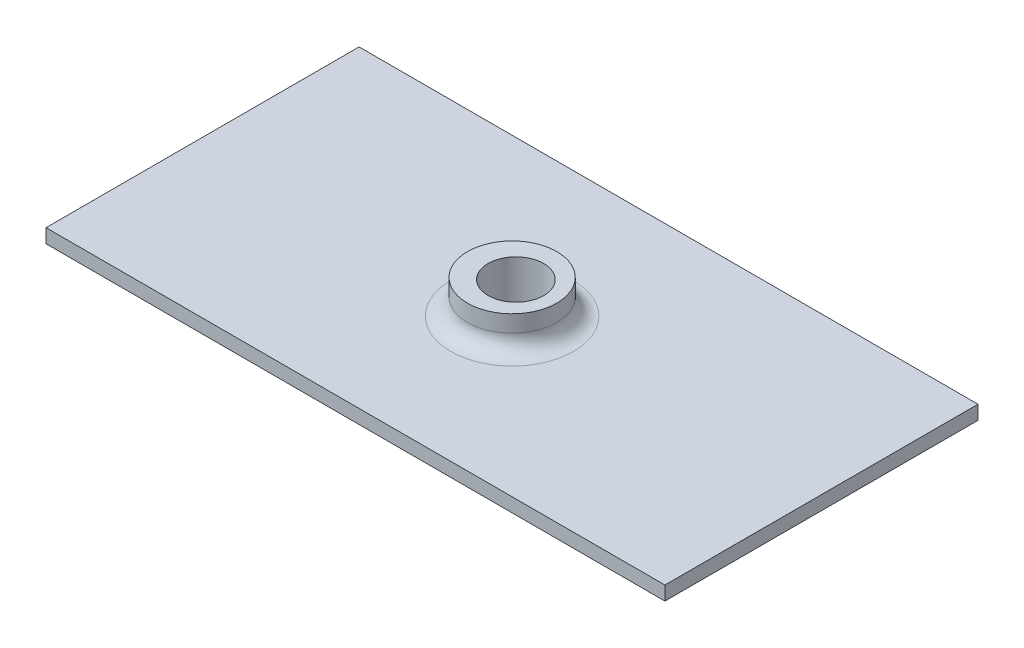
ISO-10303-21;
HEADER;
FILE_DESCRIPTION(('STEP AP214'),'2;1');
FILE_NAME('part.step','',(''),(''),'','','');
FILE_SCHEMA(('AUTOMOTIVE_DESIGN { 1 0 10303 214 1 1 1 1 }'));
ENDSEC;
DATA;
#1=APPLICATION_CONTEXT('core data for automotive mechanical design processes');
#2=APPLICATION_PROTOCOL_DEFINITION('international standard','automotive_design',2000,#1);
#3=PRODUCT_CONTEXT('',#1,'mechanical');
#4=PRODUCT('Part','Part','',(#3));
#5=PRODUCT_RELATED_PRODUCT_CATEGORY('part','',(#4));
#6=PRODUCT_DEFINITION_FORMATION('','',#4);
#7=PRODUCT_DEFINITION_CONTEXT('part definition',#1,'design');
#8=PRODUCT_DEFINITION('design','',#6,#7);
#9=PRODUCT_DEFINITION_SHAPE('','',#8);
#10=(LENGTH_UNIT() NAMED_UNIT(*) SI_UNIT(.MILLI.,.METRE.));
#11=(NAMED_UNIT(*) PLANE_ANGLE_UNIT() SI_UNIT($,.RADIAN.));
#12=(NAMED_UNIT(*) SI_UNIT($,.STERADIAN.) SOLID_ANGLE_UNIT());
#13=UNCERTAINTY_MEASURE_WITH_UNIT(LENGTH_MEASURE(1.E-05),#10,'distance_accuracy_value','');
#14=(GEOMETRIC_REPRESENTATION_CONTEXT(3) GLOBAL_UNCERTAINTY_ASSIGNED_CONTEXT((#13)) GLOBAL_UNIT_ASSIGNED_CONTEXT((#10,
#11,#12)) REPRESENTATION_CONTEXT('',''));
#15=CARTESIAN_POINT('',(0.,0.,0.));
#16=DIRECTION('',(0.,0.,1.));
#17=DIRECTION('',(1.,0.,0.));
#18=AXIS2_PLACEMENT_3D('',#15,#16,#17);
#19=CARTESIAN_POINT('',(0.,2.5,-28.05));
#20=DIRECTION('',(0.,0.,-1.));
#21=DIRECTION('',(-1.,0.,0.));
#22=AXIS2_PLACEMENT_3D('',#19,#20,#21);
#23=PLANE('',#22);
#24=DIRECTION('',(1.,0.,0.));
#25=VECTOR('',#24,1.);
#26=CARTESIAN_POINT('',(0.,0.,-28.05));
#27=LINE('',#26,#25);
#28=CARTESIAN_POINT('',(-56.1500000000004,0.,-28.0499999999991));
#29=VERTEX_POINT('',#28);
#30=CARTESIAN_POINT('',(54.75,0.,-28.05));
#31=VERTEX_POINT('',#30);
#32=EDGE_CURVE('E113',#29,#31,#27,.T.);
#33=ORIENTED_EDGE('',*,*,#32,.F.);
#34=DIRECTION('',(0.,-1.,0.));
#35=VECTOR('',#34,1.);
#36=CARTESIAN_POINT('',(-56.1500000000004,2.5,-28.0499999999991));
#37=LINE('',#36,#35);
#38=CARTESIAN_POINT('',(-56.1500000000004,2.5,-28.0499999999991));
#39=VERTEX_POINT('',#38);
#40=EDGE_CURVE('E88',#39,#29,#37,.T.);
#41=ORIENTED_EDGE('',*,*,#40,.F.);
#42=DIRECTION('',(1.,0.,0.));
#43=VECTOR('',#42,1.);
#44=CARTESIAN_POINT('',(0.,2.5,-28.05));
#45=LINE('',#44,#43);
#46=CARTESIAN_POINT('',(54.75,2.5,-28.05));
#47=VERTEX_POINT('',#46);
#48=EDGE_CURVE('E106',#39,#47,#45,.T.);
#49=ORIENTED_EDGE('',*,*,#48,.T.);
#50=DIRECTION('',(0.,-1.,0.));
#51=VECTOR('',#50,1.);
#52=CARTESIAN_POINT('',(54.75,2.5,-28.05));
#53=LINE('',#52,#51);
#54=EDGE_CURVE('E85',#47,#31,#53,.T.);
#55=ORIENTED_EDGE('',*,*,#54,.T.);
#56=EDGE_LOOP('',(#33,#41,#49,#55));
#57=FACE_BOUND('',#56,.T.);
#58=ADVANCED_FACE('F45',(#57),#23,.T.);
#59=CARTESIAN_POINT('',(-56.1500000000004,2.5,0.));
#60=DIRECTION('',(-1.,0.,0.));
#61=DIRECTION('',(0.,0.,1.));
#62=AXIS2_PLACEMENT_3D('',#59,#60,#61);
#63=PLANE('',#62);
#64=DIRECTION('',(0.,0.,-1.));
#65=VECTOR('',#64,1.);
#66=CARTESIAN_POINT('',(-56.1500000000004,0.,0.));
#67=LINE('',#66,#65);
#68=CARTESIAN_POINT('',(-56.1500000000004,0.,28.0499999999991));
#69=VERTEX_POINT('',#68);
#70=EDGE_CURVE('E98',#69,#29,#67,.T.);
#71=ORIENTED_EDGE('',*,*,#70,.F.);
#72=DIRECTION('',(0.,-1.,0.));
#73=VECTOR('',#72,1.);
#74=CARTESIAN_POINT('',(-56.1500000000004,2.5,28.0499999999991));
#75=LINE('',#74,#73);
#76=CARTESIAN_POINT('',(-56.1500000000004,2.5,28.0499999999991));
#77=VERTEX_POINT('',#76);
#78=EDGE_CURVE('E93',#77,#69,#75,.T.);
#79=ORIENTED_EDGE('',*,*,#78,.F.);
#80=DIRECTION('',(0.,0.,-1.));
#81=VECTOR('',#80,1.);
#82=CARTESIAN_POINT('',(-56.1500000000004,2.5,0.));
#83=LINE('',#82,#81);
#84=EDGE_CURVE('E96',#77,#39,#83,.T.);
#85=ORIENTED_EDGE('',*,*,#84,.T.);
#86=ORIENTED_EDGE('',*,*,#40,.T.);
#87=EDGE_LOOP('',(#71,#79,#85,#86));
#88=FACE_BOUND('',#87,.T.);
#89=ADVANCED_FACE('F95',(#88),#63,.T.);
#90=CARTESIAN_POINT('',(-1.82818789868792E-11,2.5,28.0500000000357));
#91=DIRECTION('',(-6.51760391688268E-13,0.,1.));
#92=DIRECTION('',(1.,0.,6.51760391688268E-13));
#93=AXIS2_PLACEMENT_3D('',#90,#91,#92);
#94=PLANE('',#93);
#95=DIRECTION('',(-1.,0.,-6.51760391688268E-13));
#96=VECTOR('',#95,1.);
#97=CARTESIAN_POINT('',(-1.82818789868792E-11,0.,28.0500000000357));
#98=LINE('',#97,#96);
#99=CARTESIAN_POINT('',(54.75,0.,28.05));
#100=VERTEX_POINT('',#99);
#101=EDGE_CURVE('E118',#100,#69,#98,.T.);
#102=ORIENTED_EDGE('',*,*,#101,.F.);
#103=DIRECTION('',(0.,-1.,0.));
#104=VECTOR('',#103,1.);
#105=CARTESIAN_POINT('',(54.75,2.5,28.05));
#106=LINE('',#105,#104);
#107=CARTESIAN_POINT('',(54.75,2.5,28.05));
#108=VERTEX_POINT('',#107);
#109=EDGE_CURVE('E78',#108,#100,#106,.T.);
#110=ORIENTED_EDGE('',*,*,#109,.F.);
#111=DIRECTION('',(-1.,0.,-6.51760391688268E-13));
#112=VECTOR('',#111,1.);
#113=CARTESIAN_POINT('',(-1.82818789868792E-11,2.5,28.0500000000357));
#114=LINE('',#113,#112);
#115=EDGE_CURVE('E105',#108,#77,#114,.T.);
#116=ORIENTED_EDGE('',*,*,#115,.T.);
#117=ORIENTED_EDGE('',*,*,#78,.T.);
#118=EDGE_LOOP('',(#102,#110,#116,#117));
#119=FACE_BOUND('',#118,.T.);
#120=ADVANCED_FACE('F108',(#119),#94,.T.);
#121=CARTESIAN_POINT('',(54.75,2.5,0.));
#122=DIRECTION('',(-1.,0.,0.));
#123=DIRECTION('',(0.,0.,1.));
#124=AXIS2_PLACEMENT_3D('',#121,#122,#123);
#125=PLANE('',#124);
#126=DIRECTION('',(0.,0.,-1.));
#127=VECTOR('',#126,1.);
#128=CARTESIAN_POINT('',(54.75,0.,0.));
#129=LINE('',#128,#127);
#130=EDGE_CURVE('E120',#100,#31,#129,.T.);
#131=ORIENTED_EDGE('',*,*,#130,.T.);
#132=ORIENTED_EDGE('',*,*,#54,.F.);
#133=DIRECTION('',(0.,0.,-1.));
#134=VECTOR('',#133,1.);
#135=CARTESIAN_POINT('',(54.75,2.5,0.));
#136=LINE('',#135,#134);
#137=EDGE_CURVE('E62',#108,#47,#136,.T.);
#138=ORIENTED_EDGE('',*,*,#137,.F.);
#139=ORIENTED_EDGE('',*,*,#109,.T.);
#140=EDGE_LOOP('',(#131,#132,#138,#139));
#141=FACE_BOUND('',#140,.T.);
#142=ADVANCED_FACE('F151',(#141),#125,.F.);
#143=CARTESIAN_POINT('',(0.,2.5,0.));
#144=DIRECTION('',(0.,1.,0.));
#145=DIRECTION('',(0.,0.,1.));
#146=AXIS2_PLACEMENT_3D('',#143,#144,#145);
#147=PLANE('',#146);
#148=CARTESIAN_POINT('',(-0.674999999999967,2.5,0.));
#149=DIRECTION('',(0.,1.,0.));
#150=DIRECTION('',(0.,0.,1.));
#151=AXIS2_PLACEMENT_3D('',#148,#149,#150);
#152=CIRCLE('',#151,11.);
#153=CARTESIAN_POINT('',(-0.674999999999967,2.5,11.));
#154=VERTEX_POINT('',#153);
#155=EDGE_CURVE('E12',#154,#154,#152,.F.);
#156=ORIENTED_EDGE('',*,*,#155,.T.);
#157=EDGE_LOOP('',(#156));
#158=FACE_BOUND('',#157,.T.);
#159=ORIENTED_EDGE('',*,*,#48,.F.);
#160=ORIENTED_EDGE('',*,*,#84,.F.);
#161=ORIENTED_EDGE('',*,*,#115,.F.);
#162=ORIENTED_EDGE('',*,*,#137,.T.);
#163=EDGE_LOOP('',(#159,#160,#161,#162));
#164=FACE_BOUND('',#163,.T.);
#165=ADVANCED_FACE('F104',(#158,#164),#147,.T.);
#166=CARTESIAN_POINT('',(0.,0.,0.));
#167=DIRECTION('',(0.,1.,0.));
#168=DIRECTION('',(0.,0.,1.));
#169=AXIS2_PLACEMENT_3D('',#166,#167,#168);
#170=PLANE('',#169);
#171=CARTESIAN_POINT('',(0.,0.,0.));
#172=DIRECTION('',(0.,1.,0.));
#173=DIRECTION('',(0.,0.,1.));
#174=AXIS2_PLACEMENT_3D('',#171,#172,#173);
#175=CIRCLE('',#174,4.984);
#176=CARTESIAN_POINT('',(0.,0.,4.984));
#177=VERTEX_POINT('',#176);
#178=EDGE_CURVE('E266',#177,#177,#175,.T.);
#179=ORIENTED_EDGE('',*,*,#178,.T.);
#180=EDGE_LOOP('',(#179));
#181=FACE_BOUND('',#180,.T.);
#182=ORIENTED_EDGE('',*,*,#32,.T.);
#183=ORIENTED_EDGE('',*,*,#130,.F.);
#184=ORIENTED_EDGE('',*,*,#101,.T.);
#185=ORIENTED_EDGE('',*,*,#70,.T.);
#186=EDGE_LOOP('',(#182,#183,#184,#185));
#187=FACE_BOUND('',#186,.T.);
#188=ADVANCED_FACE('F154',(#181,#187),#170,.F.);
#189=CARTESIAN_POINT('',(-0.674999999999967,8.5,0.));
#190=DIRECTION('',(0.,-1.,0.));
#191=DIRECTION('',(0.,0.,-1.));
#192=AXIS2_PLACEMENT_3D('',#189,#190,#191);
#193=CYLINDRICAL_SURFACE('',#192,8.);
#194=CARTESIAN_POINT('',(-0.674999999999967,5.5,0.));
#195=DIRECTION('',(0.,1.,0.));
#196=DIRECTION('',(0.,0.,1.));
#197=AXIS2_PLACEMENT_3D('',#194,#195,#196);
#198=CIRCLE('',#197,8.);
#199=CARTESIAN_POINT('',(-0.674999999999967,5.5,8.));
#200=VERTEX_POINT('',#199);
#201=EDGE_CURVE('E54',#200,#200,#198,.T.);
#202=ORIENTED_EDGE('',*,*,#201,.T.);
#203=EDGE_LOOP('',(#202));
#204=FACE_BOUND('',#203,.T.);
#205=CARTESIAN_POINT('',(-0.674999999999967,8.5,0.));
#206=DIRECTION('',(0.,1.,0.));
#207=DIRECTION('',(0.,0.,1.));
#208=AXIS2_PLACEMENT_3D('',#205,#206,#207);
#209=CIRCLE('',#208,8.);
#210=CARTESIAN_POINT('',(-0.674999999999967,8.5,8.));
#211=VERTEX_POINT('',#210);
#212=EDGE_CURVE('E116',#211,#211,#209,.T.);
#213=ORIENTED_EDGE('',*,*,#212,.F.);
#214=EDGE_LOOP('',(#213));
#215=FACE_BOUND('',#214,.T.);
#216=ADVANCED_FACE('F127',(#204,#215),#193,.T.);
#217=CARTESIAN_POINT('',(0.,8.5,0.));
#218=DIRECTION('',(0.,1.,0.));
#219=DIRECTION('',(0.,0.,1.));
#220=AXIS2_PLACEMENT_3D('',#217,#218,#219);
#221=PLANE('',#220);
#222=CARTESIAN_POINT('',(0.,8.5,0.));
#223=DIRECTION('',(0.,1.,0.));
#224=DIRECTION('',(0.,0.,1.));
#225=AXIS2_PLACEMENT_3D('',#222,#223,#224);
#226=CIRCLE('',#225,4.984);
#227=CARTESIAN_POINT('',(0.,8.5,4.984));
#228=VERTEX_POINT('',#227);
#229=EDGE_CURVE('E271',#228,#228,#226,.T.);
#230=ORIENTED_EDGE('',*,*,#229,.F.);
#231=EDGE_LOOP('',(#230));
#232=FACE_BOUND('',#231,.T.);
#233=ORIENTED_EDGE('',*,*,#212,.T.);
#234=EDGE_LOOP('',(#233));
#235=FACE_BOUND('',#234,.T.);
#236=ADVANCED_FACE('F132',(#232,#235),#221,.T.);
#237=CARTESIAN_POINT('',(-0.674999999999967,5.5,0.));
#238=DIRECTION('',(0.,1.,0.));
#239=DIRECTION('',(0.,0.,1.));
#240=AXIS2_PLACEMENT_3D('',#237,#238,#239);
#241=TOROIDAL_SURFACE('',#240,11.,3.);
#242=ORIENTED_EDGE('',*,*,#155,.F.);
#243=EDGE_LOOP('',(#242));
#244=FACE_BOUND('',#243,.T.);
#245=ORIENTED_EDGE('',*,*,#201,.F.);
#246=EDGE_LOOP('',(#245));
#247=FACE_BOUND('',#246,.T.);
#248=ADVANCED_FACE('F47',(#244,#247),#241,.F.);
#249=CARTESIAN_POINT('',(0.,8.5,0.));
#250=DIRECTION('',(0.,1.,0.));
#251=DIRECTION('',(0.,0.,1.));
#252=AXIS2_PLACEMENT_3D('',#249,#250,#251);
#253=CYLINDRICAL_SURFACE('',#252,4.984);
#254=ORIENTED_EDGE('',*,*,#178,.F.);
#255=EDGE_LOOP('',(#254));
#256=FACE_BOUND('',#255,.T.);
#257=ORIENTED_EDGE('',*,*,#229,.T.);
#258=EDGE_LOOP('',(#257));
#259=FACE_BOUND('',#258,.T.);
#260=ADVANCED_FACE('F131',(#256,#259),#253,.F.);
#261=CLOSED_SHELL('',(#58,#89,#120,#142,#165,#188,#216,#236,#248,#260));
#262=MANIFOLD_SOLID_BREP('B2',#261);
#263=ADVANCED_BREP_SHAPE_REPRESENTATION('',(#18,#262),#14);
#264=SHAPE_DEFINITION_REPRESENTATION(#9,#263);
ENDSEC;
END-ISO-10303-21;
